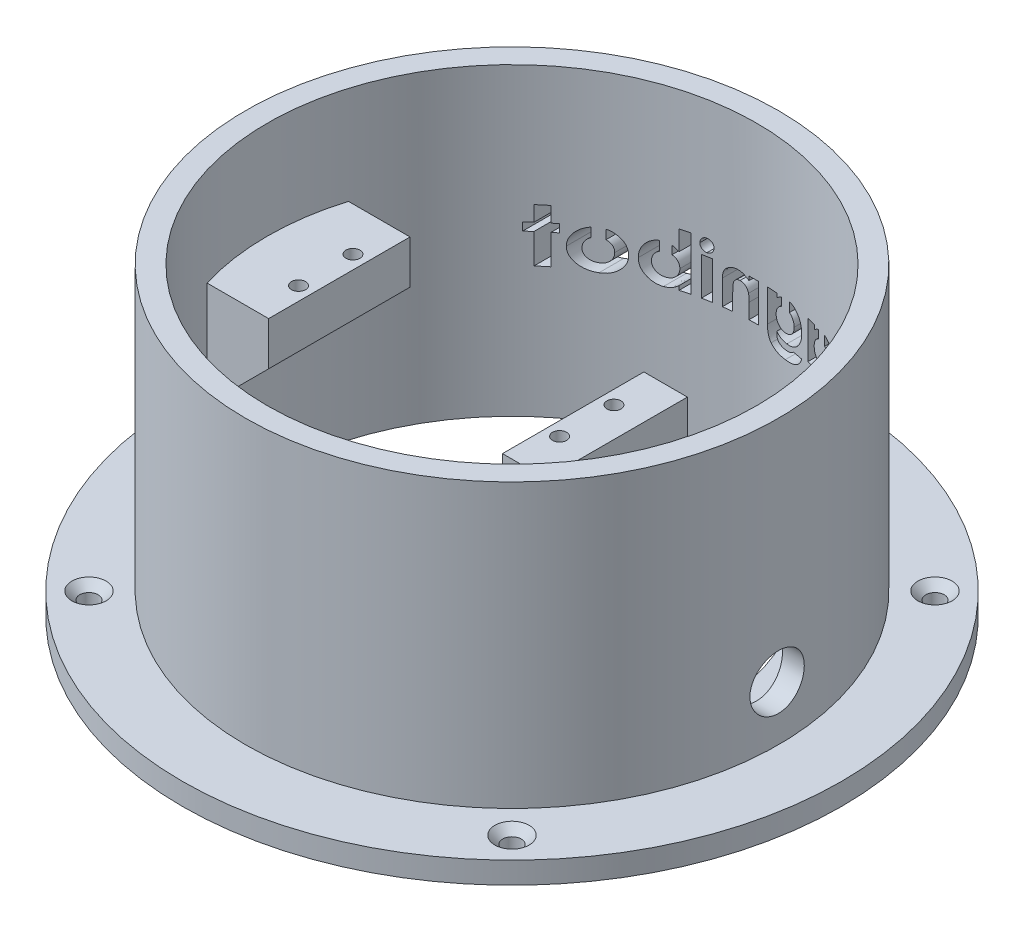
from build123d import *

# Parameters (mm, degrees)
SKETCH1_R                                           = 60.625
SKETCH1_R_2                                         = 45
BOSS_EXTRUDE1_DEPTH                                 = 4
SKETCH2_R                                           = 49
SKETCH2_R_2                                         = 45
BOSS_EXTRUDE2_DEPTH                                 = 52
SKETCH4_W                                           = 13.25
SKETCH4_H                                           = 8
SKETCH4_W_2                                         = 8
SKETCH4_H_2                                         = 38
BOSS_EXTRUDE4_DEPTH                                 = 13
BOSS_EXTRUDE5_DEPTH                                 = 4
SKETCH7_R                                           = 1.3
CUT_EXTRUDE4_DEPTH                                  = 7.2
SKETCH9_W                                           = 10
SKETCH9_H                                           = 24
CUT_EXTRUDE7_DEPTH                                  = 8
CUT_EXTRUDE8_REACH                                  = 139.219
CUT_EXTRUDE8_END_RADIUS                             = 45
SKETCH11_R                                          = 5
CUT_EXTRUDE9_DEPTH                                  = 101.273532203
CSK_FOR_M3_COUNTERSUNK_FLAT_HEAD_SCREW1_D           = 3.4
CSK_FOR_M3_COUNTERSUNK_FLAT_HEAD_SCREW1_CSINK_D     = 6.3
CSK_FOR_M3_COUNTERSUNK_FLAT_HEAD_SCREW1_CSINK_ANGLE = 90
SKETCH18_W                                          = 1.709615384
SKETCH18_H                                          = 6.960576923
CUT_EXTRUDE10_DEPTH                                 = 45


with BuildPart() as part:
    # Sketch1 → Boss-Extrude1 (new body)
    with BuildSketch(Plane(origin=(0, 0, 0), x_dir=(1, 0, 0), z_dir=(0, 1, 0))):
        with Locations(Location((0, 0, 0), (0, 0, 270))):
            Circle(SKETCH1_R)
        with Locations(Location((0, 0, 0), (0, 0, 270))):
            Circle(SKETCH1_R_2, mode=Mode.SUBTRACT)
    extrude(amount=BOSS_EXTRUDE1_DEPTH)

    # Sketch2 → Boss-Extrude2 (add)
    with BuildSketch(Plane(origin=(0, 4, 0), x_dir=(1, 0, 0), z_dir=(0, 1, 0))):
        with Locations(Location((0, 0, 0), (0, 0, 90))):
            Circle(SKETCH2_R)
        with Locations(Location((0, 0, 0), (0, 0, 270))):
            Circle(SKETCH2_R_2, mode=Mode.SUBTRACT)
    extrude(amount=BOSS_EXTRUDE2_DEPTH)

    # Sketch4 → Boss-Extrude4 (add, symmetric)
    with BuildSketch(Plane.XY):
        with Locations((-38.375, 34)):
            Rectangle(SKETCH4_W, SKETCH4_H)
        Polygon((-31.75, 30), (-45, 30), (-45, 16.75), align=None)
        with Locations((15.25, 19)):
            Rectangle(SKETCH4_W_2, SKETCH4_H_2)
    extrude(amount=BOSS_EXTRUDE4_DEPTH, both=True)


with BuildPart() as boss_extrude4_piece_1:
    # of the separate pieces the step leaves, piece 1, a body of its own (boss_extrude4_pieces)
    add(part.part.solids().sort_by_distance((0, 0, 60.625))[0])



with BuildPart() as boss_extrude4_piece_2:
    # of the separate pieces the step leaves, piece 2, a body of its own (boss_extrude4_pieces)
    add(part.part.solids().sort_by_distance((11.25, 38, -13))[0])


with BuildPart() as boss_extrude4_piece_1_1:
    add(boss_extrude4_piece_1.part)

    add(boss_extrude4_piece_2.part)  # Boss-Extrude5 merges Boss-Extrude4 piece 2
    # Sketch5 → Boss-Extrude5 (add)
    with BuildSketch(Plane.XZ):
        with BuildLine():
            Line((11.25, 13), (29.067400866, 34.352382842))
            ThreePointArc((29.067400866, 34.352382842), (45, 0), (29.067400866, -34.352382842))
            Line((29.067400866, -34.352382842), (11.25, -13))
            Line((11.25, -13), (11.25, 13))
        make_face()
    extrude(amount=-BOSS_EXTRUDE5_DEPTH)

    # Sketch7 → Cut-Extrude4 (cut)
    with BuildSketch(Plane(origin=(0, 38, 0), x_dir=(1, 0, 0), z_dir=(0, 1, 0))):
        with Locations(Location((-34.25, 5, 0), (0, 0, 180))):
            Circle(SKETCH7_R)
        with Locations(Location((-34.25, -5, 0), (0, 0, 180))):
            Circle(SKETCH7_R)
        with Locations(Location((13.75, 5, 0), (0, 0, 180))):
            Circle(SKETCH7_R)
        with Locations(Location((13.75, -5, 0), (0, 0, 180))):
            Circle(SKETCH7_R)
    extrude(amount=-CUT_EXTRUDE4_DEPTH, mode=Mode.SUBTRACT)

    # Sketch9 → Cut-Extrude7 (cut)
    with BuildSketch(Plane.ZY.offset(-11.25)):
        with Locations((0, 17)):
            Rectangle(SKETCH9_W, SKETCH9_H)
    extrude(amount=-CUT_EXTRUDE7_DEPTH, mode=Mode.SUBTRACT)

    # Cut-Extrude8: up to this cylinder (the profile starts outside it)
    cut_extrude8_end = Plane(origin=(0, 14, 0), z_dir=(0, -1, 0)) * Cylinder(CUT_EXTRUDE8_END_RADIUS, 369.438, mode=Mode.PRIVATE)
    # Sketch11 → Cut-Extrude8 (cut, up to the surface)
    with BuildSketch(Plane(origin=(49, 0, 0), x_dir=(0, 0, -1), z_dir=(1, 0, 0)), mode=Mode.PRIVATE) as cut_extrude8_sk1:
        with Locations((0, 14)):
            Circle(SKETCH11_R)
    cut_extrude8_tool1 = extrude(cut_extrude8_sk1.sketch, amount=-CUT_EXTRUDE8_REACH, mode=Mode.PRIVATE) - cut_extrude8_end
    add(cut_extrude8_tool1.solids().sort_by_distance((49, 14, 0))[0], mode=Mode.SUBTRACT)

    # Sketch12 → Cut-Extrude9 (cut, through all)
    with BuildSketch(Plane(origin=(0, 4, 0), x_dir=(1, 0, 0), z_dir=(0, 1, 0))):
        with BuildLine():
            Line((29.479537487, 22.359715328), (27.25, 19.687836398))
            Line((27.25, 19.687836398), (27.25, -19.687836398))
            Line((27.25, -19.687836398), (29.479537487, -22.359715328))
            ThreePointArc((29.479537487, -22.359715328), (37, 0), (29.479537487, 22.359715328))
        make_face()
        Polygon((27.25, -19.687836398), (27.25, 19.687836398), (24.25, 16.092634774), (24.25, -16.092634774), align=None)
    extrude(amount=-CUT_EXTRUDE9_DEPTH, mode=Mode.SUBTRACT)

    # CSK for M3 Countersunk Flat Head Screw1 (through all)
    with Locations(Plane(origin=(0, 4, 0), x_dir=(1, 0, 0), z_dir=(0, 1, 0))):
        with Locations((-38.890872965, 38.890872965), (-38.890872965, -38.890872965), (38.890872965, -38.890872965), (38.890872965, 38.890872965)):
            CounterSinkHole(CSK_FOR_M3_COUNTERSUNK_FLAT_HEAD_SCREW1_D / 2, CSK_FOR_M3_COUNTERSUNK_FLAT_HEAD_SCREW1_CSINK_D / 2, counter_sink_angle=CSK_FOR_M3_COUNTERSUNK_FLAT_HEAD_SCREW1_CSINK_ANGLE)

    # Sketch18 → Cut-Extrude10 (cut)
    with BuildSketch(Plane(origin=(0, 0, -13), x_dir=(-1, 0, 0), z_dir=(0, 0, -1))):
        with BuildLine():
            add(Edge.make_bspline(
                [(-26.842487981, 29.495192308), (-26.988196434, 29.498038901), (-27.204965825, 29.462307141), (-27.475994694, 29.354907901), (-27.664862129, 29.241566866), (-27.836779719, 29.100355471), (-27.987937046, 28.932127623), (-28.113371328, 28.737009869), (-28.201046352, 28.555679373), (-28.254794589, 28.392139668), (-28.294305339, 28.251942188), (-28.323177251, 28.094008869), (-28.347279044, 27.920113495), (-28.369621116, 27.730048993), (-28.385267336, 27.442939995), (-28.394826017, 27.219060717), (-28.391826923, 27.064332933)],
                knots=[0, 0, 0, 0, 0.13355216, 0.199704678, 0.267120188, 0.335277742, 0.403628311, 0.474205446, 0.54799425, 0.588135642, 0.632411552, 0.681857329, 0.73562936, 0.793897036, 0.857789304, 1, 1, 1, 1], degree=3))
            Line((-28.391826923, 27.064332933), (-28.391826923, 24))
            Line((-28.391826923, 24), (-30.101442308, 24))
            Line((-30.101442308, 24), (-30.101442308, 30.960576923))
            Line((-30.101442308, 30.960576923), (-28.391826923, 30.960576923))
            Line((-28.391826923, 30.960576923), (-28.391826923, 30.128665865))
            add(Edge.make_bspline(
                [(-28.391826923, 30.128665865), (-28.246518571, 30.28386113), (-28.00929586, 30.492748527), (-27.659062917, 30.716852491), (-27.38650362, 30.85144348), (-27.10067853, 30.954023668), (-26.698562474, 31.056158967), (-26.384211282, 31.08134908), (-26.172761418, 31.082692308)],
                knots=[0, 0, 0, 0, 0.256335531, 0.379114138, 0.500550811, 0.622115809, 0.744714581, 1, 1, 1, 1], degree=3))
            add(Edge.make_bspline(
                [(-26.172761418, 31.082692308), (-25.960830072, 31.083493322), (-25.645660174, 31.046822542), (-25.250117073, 30.912238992), (-24.976393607, 30.770998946), (-24.72038138, 30.596258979), (-24.411202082, 30.302229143), (-24.225552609, 30.035457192), (-24.12351262, 29.842457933)],
                knots=[0, 0, 0, 0, 0.251955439, 0.373413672, 0.494801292, 0.617068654, 0.7406196, 1, 1, 1, 1], degree=3))
            add(Edge.make_bspline(
                [(-24.12351262, 29.842457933), (-23.98885255, 30.038239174), (-23.754904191, 30.305456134), (-23.388343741, 30.596264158), (-23.091852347, 30.772294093), (-22.777453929, 30.911749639), (-22.333011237, 31.046004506), (-21.983922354, 31.083556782), (-21.749894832, 31.082692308)],
                knots=[0, 0, 0, 0, 0.25544547, 0.37917652, 0.501904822, 0.625344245, 0.74827832, 1, 1, 1, 1], degree=3))
            add(Edge.make_bspline(
                [(-21.749894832, 31.082692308), (-21.511457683, 31.084814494), (-21.160136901, 31.042896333), (-20.719737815, 30.899120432), (-20.425124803, 30.746464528), (-20.158725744, 30.565394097), (-19.931721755, 30.351514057), (-19.743329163, 30.112219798), (-19.620661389, 29.888780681), (-19.541360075, 29.691234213), (-19.493476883, 29.519331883), (-19.448692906, 29.327381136), (-19.416513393, 29.112802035), (-19.386505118, 28.877610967), (-19.362172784, 28.520569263), (-19.354973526, 28.241721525), (-19.355288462, 28.048888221)],
                knots=[0, 0, 0, 0, 0.16090351, 0.236985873, 0.311729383, 0.384306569, 0.453908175, 0.521546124, 0.589231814, 0.625292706, 0.665128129, 0.709631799, 0.75836798, 0.811604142, 0.869763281, 1, 1, 1, 1], degree=3))
            Line((-19.355288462, 28.048888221), (-19.355288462, 24))
            Line((-19.355288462, 24), (-21.064903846, 24))
            Line((-21.064903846, 24), (-21.064903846, 27.495552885))
            add(Edge.make_bspline(
                [(-21.064903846, 27.495552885), (-21.068140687, 27.674833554), (-21.070356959, 27.932935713), (-21.106654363, 28.25937097), (-21.137126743, 28.470145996), (-21.18072093, 28.657138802), (-21.233878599, 28.820796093), (-21.295540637, 28.961354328), (-21.369995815, 29.078798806), (-21.453385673, 29.177705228), (-21.546144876, 29.262489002), (-21.647306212, 29.334821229), (-21.757787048, 29.396493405), (-21.880480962, 29.438131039), (-22.059414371, 29.483235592), (-22.200832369, 29.497359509), (-22.29750601, 29.495192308)],
                knots=[0, 0, 0, 0, 0.200235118, 0.287286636, 0.36626042, 0.437682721, 0.501179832, 0.55802122, 0.608412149, 0.655743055, 0.701943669, 0.748215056, 0.794251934, 0.84250453, 0.892236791, 1, 1, 1, 1], degree=3))
            add(Edge.make_bspline(
                [(-22.29750601, 29.495192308), (-22.447521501, 29.496164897), (-22.671943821, 29.466348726), (-22.949430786, 29.356428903), (-23.141804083, 29.246128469), (-23.316353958, 29.108174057), (-23.469039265, 28.944596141), (-23.595136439, 28.754397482), (-23.682423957, 28.577934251), (-23.736967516, 28.418375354), (-23.775443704, 28.281726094), (-23.805431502, 28.127195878), (-23.828915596, 27.95635021), (-23.851390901, 27.768221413), (-23.866979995, 27.483641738), (-23.8765728, 27.261678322), (-23.873557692, 27.108218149)],
                knots=[0, 0, 0, 0, 0.138576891, 0.20607346, 0.274463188, 0.342600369, 0.410740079, 0.480118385, 0.552600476, 0.591784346, 0.635663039, 0.683568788, 0.736964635, 0.79487093, 0.858420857, 1, 1, 1, 1], degree=3))
            Line((-23.873557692, 27.108218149), (-23.873557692, 24))
            Line((-23.873557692, 24), (-25.583173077, 24))
            Line((-25.583173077, 24), (-25.583173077, 27.337184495))
            add(Edge.make_bspline(
                [(-25.583173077, 27.337184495), (-25.581929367, 27.480364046), (-25.587494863, 27.687209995), (-25.602902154, 27.952402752), (-25.6182858, 28.127983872), (-25.636060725, 28.288035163), (-25.661704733, 28.431681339), (-25.68864776, 28.559713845), (-25.734841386, 28.70515501), (-25.799934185, 28.866327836), (-25.897184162, 29.037243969), (-26.014771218, 29.180341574), (-26.149729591, 29.29675473), (-26.302220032, 29.385397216), (-26.529198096, 29.475712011), (-26.717247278, 29.492268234), (-26.842487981, 29.495192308)],
                knots=[0, 0, 0, 0, 0.151067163, 0.218305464, 0.280286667, 0.337063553, 0.388152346, 0.434234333, 0.474994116, 0.549030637, 0.617296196, 0.681662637, 0.743542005, 0.804319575, 0.867012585, 1, 1, 1, 1], degree=3))
        make_face()
        with BuildLine():
            Line((-10.685096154, 30.960576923), (-12.394711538, 30.960576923))
            Line((-12.394711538, 30.960576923), (-12.394711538, 30.176367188))
            add(Edge.make_bspline(
                [(-13.394766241, 30.846325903), (-13.310273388, 30.811242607), (-13.135129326, 30.729510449), (-12.789159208, 30.520493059), (-12.5451071, 30.323924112), (-12.394711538, 30.176367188)],
                knots=[0.505665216, 0.505665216, 0.505665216, 0.505665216, 0.617680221, 0.742091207, 1, 1, 1, 1], degree=3))
            Line((-13.394766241, 30.846325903), (-13.394766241, 29.329440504))
            add(Edge.make_bspline(
                [(-12.272596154, 27.49936899), (-12.275060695, 27.640851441), (-12.286903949, 27.850610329), (-12.347552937, 28.118783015), (-12.407830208, 28.305751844), (-12.486754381, 28.48203362), (-12.585417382, 28.645666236), (-12.69736389, 28.802320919), (-12.829721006, 28.943228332), (-12.971811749, 29.07413986), (-13.126905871, 29.186060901), (-13.268832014, 29.269936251), (-13.359799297, 29.313990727), (-13.394766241, 29.329440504)],
                knots=[0, 0, 0, 0, 0.135095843, 0.199062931, 0.26154836, 0.322044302, 0.382646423, 0.443384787, 0.505154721, 0.566515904, 0.627254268, 0.687026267, 0.723436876, 0.723436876, 0.723436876, 0.723436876], degree=3))
            add(Edge.make_bspline(
                [(-14.235982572, 25.465384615), (-14.10011477, 25.467643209), (-13.898799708, 25.480332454), (-13.640806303, 25.53963291), (-13.460804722, 25.604109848), (-13.288221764, 25.681696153), (-13.124620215, 25.777647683), (-12.971773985, 25.89305892), (-12.828909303, 26.024925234), (-12.698001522, 26.169745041), (-12.58481344, 26.328550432), (-12.486224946, 26.496261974), (-12.408680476, 26.676846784), (-12.347134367, 26.867138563), (-12.286934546, 27.140607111), (-12.275196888, 27.354702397), (-12.272596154, 27.49936899)],
                knots=[0, 0, 0, 0, 0.128661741, 0.189789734, 0.249707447, 0.309188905, 0.368499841, 0.428643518, 0.489936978, 0.552121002, 0.612878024, 0.674050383, 0.735729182, 0.798304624, 0.862952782, 1, 1, 1, 1], degree=3))
            add(Edge.make_bspline(
                [(-16.180288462, 27.493644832), (-16.177753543, 27.352107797), (-16.165553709, 27.142550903), (-16.105972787, 26.873813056), (-16.042025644, 26.686589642), (-15.963884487, 26.507939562), (-15.868781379, 26.338693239), (-15.75196058, 26.181841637), (-15.622339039, 26.033673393), (-15.477365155, 25.901365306), (-15.324904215, 25.783886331), (-15.162873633, 25.685597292), (-14.993031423, 25.606139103), (-14.815948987, 25.541463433), (-14.564127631, 25.483260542), (-14.368366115, 25.465966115), (-14.235982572, 25.465384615)],
                knots=[0, 0, 0, 0, 0.135364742, 0.199460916, 0.262263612, 0.323991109, 0.385461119, 0.447170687, 0.510418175, 0.573170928, 0.634270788, 0.693953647, 0.753722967, 0.813083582, 0.873628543, 1, 1, 1, 1], degree=3))
            add(Edge.make_bspline(
                [(-15.104766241, 29.310891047), (-15.128357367, 29.299714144), (-15.207610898, 29.260034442), (-15.337370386, 29.180793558), (-15.488973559, 29.065116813), (-15.631033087, 28.934431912), (-15.760541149, 28.790785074), (-15.872185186, 28.634035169), (-15.967062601, 28.468406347), (-16.047311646, 28.293397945), (-16.10472424, 28.106949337), (-16.166516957, 27.841905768), (-16.177251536, 27.633746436), (-16.180288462, 27.493644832)],
                knots=[0.284645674, 0.284645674, 0.284645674, 0.284645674, 0.30974405, 0.369855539, 0.430536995, 0.492876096, 0.555257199, 0.616197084, 0.67757746, 0.738630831, 0.800921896, 0.864881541, 1, 1, 1, 1], degree=3))
            Line((-15.104766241, 29.310891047), (-15.104766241, 31.04733117))
            add(Edge.make_bspline(
                [(-17.889903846, 27.466932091), (-17.887893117, 27.720081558), (-17.86504439, 28.095154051), (-17.760403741, 28.575169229), (-17.655770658, 28.910764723), (-17.521064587, 29.22848271), (-17.357029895, 29.5288338), (-17.161404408, 29.811035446), (-16.935982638, 30.070283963), (-16.692582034, 30.307896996), (-16.432186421, 30.514760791), (-16.158868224, 30.690491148), (-15.872334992, 30.833991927), (-15.57263517, 30.944747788), (-15.315122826, 31.012054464), (-15.157587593, 31.039528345), (-15.104766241, 31.04733117)],
                knots=[0, 0, 0, 0, 0.139308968, 0.205473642, 0.26959838, 0.332253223, 0.394830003, 0.45737553, 0.520581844, 0.583374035, 0.644082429, 0.703039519, 0.761664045, 0.819843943, 0.878346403, 0.907680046, 0.907680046, 0.907680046, 0.907680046], degree=3))
            add(Edge.make_bspline(
                [(-14.550811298, 23.877884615), (-14.771194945, 23.875519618), (-15.097918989, 23.909256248), (-15.518197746, 24.017521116), (-15.819029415, 24.13040656), (-16.107936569, 24.27691408), (-16.387131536, 24.452984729), (-16.651827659, 24.664864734), (-16.904228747, 24.903368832), (-17.135325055, 25.165726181), (-17.337353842, 25.448294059), (-17.507641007, 25.747064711), (-17.647178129, 26.061049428), (-17.756829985, 26.390010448), (-17.863179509, 26.856878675), (-17.889066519, 27.221178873), (-17.889903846, 27.466932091)],
                knots=[0, 0, 0, 0, 0.121092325, 0.179634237, 0.238303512, 0.297437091, 0.357506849, 0.419513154, 0.483600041, 0.548295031, 0.611486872, 0.674312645, 0.737107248, 0.800159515, 0.864737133, 1, 1, 1, 1], degree=3))
            add(Edge.make_bspline(
                [(-12.394711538, 24.759405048), (-12.556438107, 24.613336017), (-12.80579393, 24.412909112), (-13.162727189, 24.202367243), (-13.424496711, 24.08000868), (-13.692348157, 23.989796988), (-14.064934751, 23.90107922), (-14.355434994, 23.879194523), (-14.550811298, 23.877884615)],
                knots=[0, 0, 0, 0, 0.273943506, 0.399987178, 0.519718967, 0.636176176, 0.754371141, 1, 1, 1, 1], degree=3))
            Line((-12.394711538, 24.759405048), (-12.394711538, 24))
            Line((-12.394711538, 24), (-10.685096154, 24))
            Line((-10.685096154, 24), (-10.685096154, 30.960576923))
        make_face()
        with BuildLine():
            Line((-2.014903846, 30.960576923), (-3.846634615, 30.960576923))
            Line((-3.846634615, 30.960576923), (-3.846634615, 30.185907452))
            add(Edge.make_bspline(
                [(-4.767307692, 30.814230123), (-4.724477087, 30.794772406), (-4.590493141, 30.729827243), (-4.269492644, 30.538805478), (-4.012351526, 30.336800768), (-3.846634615, 30.185907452)],
                knots=[0.536763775, 0.536763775, 0.536763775, 0.536763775, 0.595177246, 0.721609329, 1, 1, 1, 1], degree=3))
            Line((-4.767307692, 30.814230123), (-4.767307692, 29.320900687))
            add(Edge.make_bspline(
                [(-3.724519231, 27.547070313), (-3.723985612, 27.684921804), (-3.738077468, 27.888553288), (-3.795878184, 28.149010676), (-3.852746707, 28.331467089), (-3.92694536, 28.503911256), (-4.019968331, 28.66473411), (-4.126349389, 28.81690634), (-4.251607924, 28.955244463), (-4.386618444, 29.083193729), (-4.535464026, 29.191438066), (-4.662702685, 29.26982308), (-4.741830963, 29.309083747), (-4.767307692, 29.320900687)],
                knots=[0, 0, 0, 0, 0.135592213, 0.199608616, 0.261894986, 0.32322003, 0.383707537, 0.444249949, 0.505361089, 0.566851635, 0.626748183, 0.685935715, 0.713527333, 0.713527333, 0.713527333, 0.713527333], degree=3))
            add(Edge.make_bspline(
                [(-5.584870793, 25.5875), (-5.454885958, 25.585020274), (-5.263798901, 25.604031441), (-5.018163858, 25.660529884), (-4.845887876, 25.719523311), (-4.683344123, 25.796656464), (-4.528349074, 25.888670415), (-4.38419113, 26.000026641), (-4.248136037, 26.125920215), (-4.125355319, 26.26591114), (-4.016979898, 26.417589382), (-3.927957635, 26.580982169), (-3.852112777, 26.753503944), (-3.796017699, 26.93758312), (-3.737790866, 27.201095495), (-3.724286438, 27.407370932), (-3.724519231, 27.547070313)],
                knots=[0, 0, 0, 0, 0.128347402, 0.189067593, 0.248938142, 0.308023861, 0.366703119, 0.426834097, 0.487804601, 0.549753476, 0.610659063, 0.671749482, 0.733442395, 0.796702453, 0.861717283, 1, 1, 1, 1], degree=3))
            add(Edge.make_bspline(
                [(-7.510096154, 27.560426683), (-7.512631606, 27.421551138), (-7.493433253, 27.218005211), (-7.437602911, 26.955335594), (-7.376070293, 26.772902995), (-7.298907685, 26.599118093), (-7.206250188, 26.434062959), (-7.09186074, 26.281684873), (-6.964837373, 26.138630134), (-6.824314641, 26.009292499), (-6.67305439, 25.896795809), (-6.514171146, 25.799646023), (-6.344228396, 25.723890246), (-6.166910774, 25.66253924), (-5.914630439, 25.602081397), (-5.71748417, 25.59010512), (-5.584870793, 25.5875)],
                knots=[0, 0, 0, 0, 0.134674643, 0.197931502, 0.260447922, 0.321293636, 0.382442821, 0.443853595, 0.505984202, 0.568071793, 0.628986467, 0.688848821, 0.748567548, 0.80932852, 0.870916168, 1, 1, 1, 1], degree=3))
            add(Edge.make_bspline(
                [(-6.477307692, 29.308506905), (-6.496110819, 29.299218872), (-6.569021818, 29.261444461), (-6.691391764, 29.186398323), (-6.840503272, 29.074852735), (-6.977284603, 28.945757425), (-7.10407087, 28.806266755), (-7.210527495, 28.652749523), (-7.305390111, 28.493946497), (-7.379193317, 28.323470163), (-7.440093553, 28.14593706), (-7.491184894, 27.890883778), (-7.513785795, 27.694490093), (-7.510096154, 27.560426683)],
                knots=[0.292846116, 0.292846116, 0.292846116, 0.292846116, 0.313596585, 0.374077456, 0.434784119, 0.497609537, 0.5600519, 0.621032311, 0.682272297, 0.742887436, 0.804620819, 0.867735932, 1, 1, 1, 1], degree=3))
            Line((-6.477307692, 29.308506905), (-6.477307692, 31.053484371))
            add(Edge.make_bspline(
                [(-8.210351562, 30.182091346), (-8.062892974, 30.32841237), (-7.824605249, 30.524618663), (-7.477383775, 30.735792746), (-7.208361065, 30.861886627), (-6.928782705, 30.96208958), (-6.683039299, 31.021567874), (-6.531127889, 31.046194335), (-6.477307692, 31.053484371)],
                knots=[0, 0, 0, 0, 0.256681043, 0.3797841, 0.501470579, 0.623319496, 0.746312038, 0.8134232, 0.8134232, 0.8134232, 0.8134232], degree=3))
            add(Edge.make_bspline(
                [(-9.219711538, 27.541346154), (-9.221119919, 27.802624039), (-9.190880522, 28.187260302), (-9.085236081, 28.680667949), (-8.975256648, 29.02328411), (-8.830419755, 29.344336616), (-8.597264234, 29.747009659), (-8.376926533, 30.019294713), (-8.210351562, 30.182091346)],
                knots=[0, 0, 0, 0, 0.269734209, 0.396745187, 0.520318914, 0.64054729, 0.759723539, 1, 1, 1, 1], degree=3))
            add(Edge.make_bspline(
                [(-5.930228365, 24), (-6.152932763, 23.998495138), (-6.483421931, 24.029911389), (-6.90743633, 24.135684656), (-7.208893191, 24.243870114), (-7.494840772, 24.387709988), (-7.769346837, 24.558788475), (-8.027324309, 24.766145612), (-8.272332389, 24.998190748), (-8.493775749, 25.256120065), (-8.688634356, 25.533135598), (-8.852897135, 25.827326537), (-8.986509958, 26.13842036), (-9.092853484, 26.465107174), (-9.192743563, 26.93200642), (-9.218830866, 27.295560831), (-9.219711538, 27.541346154)],
                knots=[0, 0, 0, 0, 0.123700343, 0.183445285, 0.242476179, 0.301272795, 0.36098846, 0.421869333, 0.484863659, 0.548268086, 0.61043108, 0.672769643, 0.735140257, 0.798288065, 0.863379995, 1, 1, 1, 1], degree=3))
            add(Edge.make_bspline(
                [(-3.846634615, 24.868164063), (-3.98909843, 24.721521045), (-4.215491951, 24.523655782), (-4.547876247, 24.317476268), (-4.797702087, 24.197316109), (-5.059589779, 24.109448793), (-5.435024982, 24.022930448), (-5.72974928, 24.001013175), (-5.930228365, 24)],
                knots=[0, 0, 0, 0, 0.263927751, 0.385523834, 0.50370538, 0.620733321, 0.741155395, 1, 1, 1, 1], degree=3))
            add(Edge.make_bspline(
                [(-5.735606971, 22.900961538), (-5.525196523, 22.899276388), (-5.22448664, 22.923597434), (-4.851215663, 23.01425836), (-4.620987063, 23.11085449), (-4.422356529, 23.226997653), (-4.256650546, 23.361885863), (-4.119825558, 23.510466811), (-4.030327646, 23.650243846), (-3.977144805, 23.77704456), (-3.940929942, 23.886535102), (-3.913430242, 24.012742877), (-3.888388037, 24.153305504), (-3.869711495, 24.310034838), (-3.852264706, 24.549844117), (-3.844166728, 24.73762836), (-3.846634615, 24.868164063)],
                knots=[0, 0, 0, 0, 0.19772075, 0.282265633, 0.359994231, 0.431569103, 0.497870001, 0.560090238, 0.620807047, 0.652681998, 0.689174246, 0.729059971, 0.773983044, 0.823375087, 0.877349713, 1, 1, 1, 1], degree=3))
            add(Edge.make_bspline(
                [(-7.326923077, 23.511538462), (-7.242380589, 23.410960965), (-7.09438231, 23.276179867), (-6.865258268, 23.136766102), (-6.674394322, 23.050135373), (-6.464624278, 22.984387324), (-6.152217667, 22.915381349), (-5.904480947, 22.901982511), (-5.735606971, 22.900961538)],
                knots=[0, 0, 0, 0, 0.22365493, 0.337943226, 0.455777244, 0.579824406, 0.711809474, 1, 1, 1, 1], degree=3))
            Line((-7.326923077, 23.511538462), (-9.22734375, 23.511538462))
            add(Edge.make_bspline(
                [(-5.607767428, 21.313461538), (-5.923289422, 21.313265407), (-6.380155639, 21.337583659), (-6.955064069, 21.447487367), (-7.329970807, 21.55820764), (-7.669881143, 21.701190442), (-7.981201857, 21.872605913), (-8.263321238, 22.077558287), (-8.520560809, 22.307942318), (-8.746742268, 22.568885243), (-9.008284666, 22.958824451), (-9.152772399, 23.284583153), (-9.22734375, 23.511538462)],
                knots=[0, 0, 0, 0, 0.207410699, 0.299345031, 0.383942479, 0.463709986, 0.54113669, 0.616854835, 0.692286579, 0.767513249, 0.843065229, 1, 1, 1, 1], degree=3))
            add(Edge.make_bspline(
                [(-2.726607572, 22.435396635), (-2.883402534, 22.249158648), (-3.157412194, 22.001321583), (-3.579225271, 21.744105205), (-3.926838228, 21.584854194), (-4.305110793, 21.463833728), (-4.864867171, 21.343405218), (-5.305869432, 21.312752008), (-5.607767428, 21.313461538)],
                knots=[0, 0, 0, 0, 0.228421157, 0.343996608, 0.46295648, 0.586702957, 0.716302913, 1, 1, 1, 1], degree=3))
            add(Edge.make_bspline(
                [(-2.014903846, 25.022716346), (-2.01605019, 24.748857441), (-2.032888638, 24.350205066), (-2.10790658, 23.841573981), (-2.185622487, 23.501846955), (-2.286280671, 23.191966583), (-2.445487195, 22.825495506), (-2.603406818, 22.579293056), (-2.726607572, 22.435396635)],
                knots=[0, 0, 0, 0, 0.300233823, 0.436256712, 0.562884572, 0.681680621, 0.792783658, 1, 1, 1, 1], degree=3))
            Line((-2.014903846, 25.022716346), (-2.014903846, 30.960576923))
        make_face()
        with BuildLine():
            add(Edge.make_bspline(
                [(1.484465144, 28.171003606), (1.466486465, 28.102133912), (1.453307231, 27.985137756), (1.43216254, 27.814589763), (1.425478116, 27.651348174), (1.414090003, 27.46451461), (1.408057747, 27.168010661), (1.404442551, 26.933984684), (1.404326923, 26.770492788)],
                knots=[0, 0, 0, 0, 0.151475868, 0.251213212, 0.366854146, 0.500124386, 0.650932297, 1, 1, 1, 1], degree=3))
            Line((1.404326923, 26.770492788), (1.404326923, 24))
            Line((1.404326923, 24), (-0.305288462, 24))
            Line((-0.305288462, 24), (-0.305288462, 30.960576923))
            Line((-0.305288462, 30.960576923), (1.404326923, 30.960576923))
            Line((1.404326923, 30.960576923), (1.404326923, 30.22406851))
            add(Edge.make_bspline(
                [(1.404326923, 30.22406851), (1.588082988, 30.372253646), (1.863824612, 30.569162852), (2.239123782, 30.781038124), (2.496605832, 30.89620558), (2.749040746, 30.978882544), (3.08353522, 31.058574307), (3.339932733, 31.083729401), (3.510817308, 31.082692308)],
                knots=[0, 0, 0, 0, 0.30498931, 0.436681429, 0.556242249, 0.668759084, 0.77937854, 1, 1, 1, 1], degree=3))
            add(Edge.make_bspline(
                [(3.510817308, 31.082692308), (3.680448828, 31.08075736), (3.933391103, 31.064483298), (4.256758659, 30.985147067), (4.487401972, 30.907574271), (4.707179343, 30.805055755), (4.99224116, 30.641514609), (5.182040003, 30.47978274), (5.302478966, 30.365264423)],
                knots=[0, 0, 0, 0, 0.257369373, 0.381171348, 0.503298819, 0.625247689, 0.747811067, 1, 1, 1, 1], degree=3))
            add(Edge.make_bspline(
                [(5.302478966, 30.365264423), (5.405932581, 30.262683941), (5.5432377, 30.088552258), (5.685323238, 29.826244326), (5.773727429, 29.609531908), (5.83891886, 29.372851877), (5.908035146, 29.024814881), (5.921535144, 28.750707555), (5.922596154, 28.5640625)],
                knots=[0, 0, 0, 0, 0.223210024, 0.337545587, 0.456528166, 0.581243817, 0.713405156, 1, 1, 1, 1], degree=3))
            Line((5.922596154, 28.5640625), (5.922596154, 24))
            Line((5.922596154, 24), (4.212980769, 24))
            Line((4.212980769, 24), (4.212980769, 27.022355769))
            add(Edge.make_bspline(
                [(4.212980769, 27.022355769), (4.212493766, 27.211243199), (4.210812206, 27.481734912), (4.1962179, 27.824407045), (4.18675366, 28.042839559), (4.168165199, 28.234750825), (4.151402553, 28.401355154), (4.125681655, 28.541141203), (4.092214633, 28.691502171), (4.033772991, 28.852490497), (3.943045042, 29.022120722), (3.827944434, 29.166217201), (3.693170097, 29.285829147), (3.538879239, 29.38034416), (3.303028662, 29.472102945), (3.109660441, 29.495738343), (2.978470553, 29.495192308)],
                knots=[0, 0, 0, 0, 0.179518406, 0.256936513, 0.325929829, 0.387212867, 0.440139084, 0.484952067, 0.522188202, 0.586422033, 0.647003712, 0.704201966, 0.760716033, 0.817414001, 0.87521257, 1, 1, 1, 1], degree=3))
            add(Edge.make_bspline(
                [(2.978470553, 29.495192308), (2.805477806, 29.493406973), (2.544941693, 29.455299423), (2.233950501, 29.302362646), (2.025539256, 29.146180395), (1.84161366, 28.953101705), (1.632730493, 28.637036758), (1.530975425, 28.363566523), (1.484465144, 28.171003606)],
                knots=[0, 0, 0, 0, 0.240657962, 0.35738999, 0.477137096, 0.600008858, 0.725224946, 1, 1, 1, 1], degree=3))
        make_face()
        with Locations((8.364903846, 27.480288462)):
            Rectangle(SKETCH18_W, SKETCH18_H)
        with BuildLine():
            add(Edge.make_bspline(
                [(7.265865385, 32.750330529), (7.26826571, 32.898800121), (7.301809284, 33.123992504), (7.442819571, 33.387441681), (7.581566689, 33.56215972), (7.748301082, 33.708202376), (8.002527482, 33.849907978), (8.217416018, 33.892511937), (8.36108774, 33.891346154)],
                knots=[0, 0, 0, 0, 0.255026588, 0.378937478, 0.506522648, 0.634371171, 0.754975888, 1, 1, 1, 1], degree=3))
            add(Edge.make_bspline(
                [(8.36108774, 33.891346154), (8.50572535, 33.893726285), (8.722578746, 33.848887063), (8.976980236, 33.702667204), (9.145189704, 33.553861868), (9.284954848, 33.37588626), (9.429451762, 33.107458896), (9.461110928, 32.876834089), (9.463942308, 32.725525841)],
                knots=[0, 0, 0, 0, 0.242962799, 0.363854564, 0.490606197, 0.618739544, 0.743300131, 1, 1, 1, 1], degree=3))
            add(Edge.make_bspline(
                [(9.463942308, 32.725525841), (9.462823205, 32.575352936), (9.426744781, 32.34888392), (9.287851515, 32.08058497), (9.146978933, 31.905250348), (8.980599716, 31.758807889), (8.731970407, 31.610310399), (8.516181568, 31.571234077), (8.374444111, 31.571153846)],
                knots=[0, 0, 0, 0, 0.256468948, 0.381954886, 0.51070434, 0.637377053, 0.757775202, 1, 1, 1, 1], degree=3))
            add(Edge.make_bspline(
                [(8.374444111, 31.571153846), (8.228392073, 31.568584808), (8.010279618, 31.613961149), (7.752417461, 31.759104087), (7.584921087, 31.910946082), (7.44360454, 32.090205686), (7.304907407, 32.365264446), (7.265535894, 32.595858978), (7.265865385, 32.750330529)],
                knots=[0, 0, 0, 0, 0.242758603, 0.363442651, 0.489711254, 0.617482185, 0.742279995, 1, 1, 1, 1], degree=3))
        make_face()
        with BuildLine():
            Line((12.516826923, 30.149654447), (12.516826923, 33.769230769))
            Line((12.516826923, 33.769230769), (10.807211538, 33.769230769))
            Line((10.807211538, 33.769230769), (10.807211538, 24))
            Line((10.807211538, 24), (12.516826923, 24))
            Line((12.516826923, 24), (12.516826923, 24.759405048))
            add(Edge.make_bspline(
                [(14.676742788, 23.877884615), (14.481340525, 23.879044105), (14.190295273, 23.90141522), (13.816420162, 23.989838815), (13.547100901, 24.079591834), (13.284859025, 24.202413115), (12.927897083, 24.412875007), (12.678560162, 24.613354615), (12.516826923, 24.759405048)],
                knots=[0, 0, 0, 0, 0.245252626, 0.364042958, 0.481077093, 0.600625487, 0.726476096, 1, 1, 1, 1], degree=3))
            add(Edge.make_bspline(
                [(18.012019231, 27.466932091), (18.011181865, 27.221178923), (17.985294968, 26.856878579), (17.878945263, 26.390010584), (17.7692939, 26.061048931), (17.629754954, 25.747066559), (17.459474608, 25.448287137), (17.257420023, 25.165752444), (17.026422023, 24.903268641), (16.774022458, 24.665571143), (16.511040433, 24.452305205), (16.232237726, 24.277564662), (15.944584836, 24.129931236), (15.643546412, 24.017226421), (15.22306157, 23.909995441), (14.896589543, 23.874990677), (14.676742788, 23.877884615)],
                knots=[0, 0, 0, 0, 0.135343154, 0.199959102, 0.263048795, 0.32588067, 0.388743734, 0.451973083, 0.516706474, 0.580831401, 0.642600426, 0.702705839, 0.761562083, 0.820266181, 0.879181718, 1, 1, 1, 1], degree=3))
            add(Edge.make_bspline(
                [(15.218097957, 31.048901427), (15.274501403, 31.040721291), (15.436248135, 31.01276704), (15.697481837, 30.94541187), (15.996490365, 30.834072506), (16.281554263, 30.6893286), (16.555871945, 30.516072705), (16.814713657, 30.307102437), (17.058205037, 30.070412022), (17.283440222, 29.810980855), (17.479354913, 29.528924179), (17.642538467, 29.22795498), (17.780866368, 28.91162813), (17.881742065, 28.574710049), (17.987743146, 28.095349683), (18.009700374, 27.719978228), (18.012019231, 27.466932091)],
                knots=[0.090050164, 0.090050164, 0.090050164, 0.090050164, 0.121379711, 0.180255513, 0.238142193, 0.296488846, 0.355775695, 0.416246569, 0.479075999, 0.542319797, 0.604902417, 0.667516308, 0.730345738, 0.794404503, 0.860608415, 1, 1, 1, 1], degree=3))
            Line((15.218097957, 31.048901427), (15.218097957, 29.314704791))
            add(Edge.make_bspline(
                [(16.302403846, 27.493644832), (16.299366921, 27.633746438), (16.28863234, 27.841905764), (16.226839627, 28.106949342), (16.169427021, 28.293397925), (16.089178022, 28.468406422), (15.994300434, 28.634034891), (15.882657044, 28.790786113), (15.753146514, 28.934427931), (15.611096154, 29.06513148), (15.459459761, 29.180740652), (15.327073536, 29.261851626), (15.244691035, 29.302412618), (15.218097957, 29.314704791)],
                knots=[0, 0, 0, 0, 0.134801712, 0.198611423, 0.260756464, 0.321666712, 0.3829032, 0.443700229, 0.505935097, 0.568128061, 0.628667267, 0.688637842, 0.716736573, 0.716736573, 0.716736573, 0.716736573], degree=3))
            add(Edge.make_bspline(
                [(14.358097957, 25.465384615), (14.490373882, 25.46633226), (14.68583074, 25.482503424), (14.937152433, 25.542290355), (15.11434859, 25.60505308), (15.283662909, 25.686858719), (15.44663417, 25.782563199), (15.597636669, 25.902145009), (15.742594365, 26.0335741), (15.872292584, 26.181788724), (15.988648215, 26.339247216), (16.086387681, 26.507354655), (16.16400061, 26.686669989), (16.228126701, 26.87379101), (16.287641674, 27.142566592), (16.299883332, 27.352099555), (16.302403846, 27.493644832)],
                knots=[0, 0, 0, 0, 0.126400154, 0.186367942, 0.246314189, 0.305548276, 0.365764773, 0.426396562, 0.489163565, 0.552425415, 0.614148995, 0.67593532, 0.737676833, 0.80049379, 0.86460452, 1, 1, 1, 1], degree=3))
            add(Edge.make_bspline(
                [(12.394711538, 27.49936899), (12.39733176, 27.354714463), (12.409013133, 27.140584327), (12.469300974, 26.867170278), (12.530611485, 26.676732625), (12.60888957, 26.496971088), (12.704293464, 26.327226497), (12.820695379, 26.17121855), (12.94886675, 26.023478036), (13.093980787, 25.893815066), (13.246613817, 25.77752438), (13.410369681, 25.681729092), (13.582911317, 25.604100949), (13.762924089, 25.539635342), (14.020913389, 25.480330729), (14.222231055, 25.467644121), (14.358097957, 25.465384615)],
                knots=[0, 0, 0, 0, 0.137033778, 0.201675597, 0.264244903, 0.325917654, 0.386784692, 0.447888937, 0.509667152, 0.571398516, 0.631536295, 0.690841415, 0.75031704, 0.810228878, 0.871350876, 1, 1, 1, 1], degree=3))
            add(Edge.make_bspline(
                [(13.508097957, 29.326291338), (13.475510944, 29.311704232), (13.386886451, 29.268645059), (13.247188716, 29.186777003), (13.09386491, 29.07271497), (12.949642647, 28.94476397), (12.820047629, 28.800818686), (12.704913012, 28.647005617), (12.609396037, 28.481322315), (12.529762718, 28.305867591), (12.469718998, 28.118750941), (12.40898317, 27.850633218), (12.397195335, 27.640839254), (12.394711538, 27.49936899)],
                knots=[0.277795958, 0.277795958, 0.277795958, 0.277795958, 0.311877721, 0.371779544, 0.432159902, 0.494105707, 0.555600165, 0.616830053, 0.677256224, 0.737883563, 0.800504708, 0.864610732, 1, 1, 1, 1], degree=3))
            Line((13.508097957, 29.326291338), (13.508097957, 30.833955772))
            add(Edge.make_bspline(
                [(12.516826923, 30.149654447), (12.668928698, 30.299917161), (12.912962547, 30.504541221), (13.258580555, 30.713964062), (13.428489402, 30.799029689), (13.508097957, 30.833955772)],
                knots=[0, 0, 0, 0, 0.260395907, 0.385476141, 0.491295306, 0.491295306, 0.491295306, 0.491295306], degree=3))
        make_face()
        with BuildLine():
            Line((21.981760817, 29.304311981), (21.981760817, 30.990172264))
            add(Edge.make_bspline(
                [(20.414257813, 30.149654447), (20.580230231, 30.302431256), (20.848059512, 30.503701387), (21.231130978, 30.721932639), (21.52441704, 30.855237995), (21.777036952, 30.938516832), (21.930908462, 30.97825349), (21.981760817, 30.990172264)],
                knots=[0, 0, 0, 0, 0.25846437, 0.382579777, 0.504990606, 0.627227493, 0.687100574, 0.687100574, 0.687100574, 0.687100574], degree=3))
            add(Edge.make_bspline(
                [(19.233173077, 27.474564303), (19.2335763, 27.732374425), (19.268375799, 28.114139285), (19.392162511, 28.603345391), (19.522692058, 28.948059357), (19.689731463, 29.27621159), (19.964736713, 29.697053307), (20.225541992, 29.976313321), (20.414257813, 30.149654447)],
                knots=[0, 0, 0, 0, 0.256473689, 0.3792365, 0.500977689, 0.622366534, 0.744855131, 1, 1, 1, 1], degree=3))
            add(Edge.make_bspline(
                [(22.801231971, 23.877884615), (22.563052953, 23.880280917), (22.208301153, 23.907196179), (21.753165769, 24.018978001), (21.42903909, 24.133926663), (21.117747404, 24.28136963), (20.822016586, 24.463816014), (20.538902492, 24.677713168), (20.273309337, 24.921242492), (20.029990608, 25.188416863), (19.817420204, 25.473623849), (19.636938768, 25.772588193), (19.488669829, 26.085653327), (19.374345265, 26.41323899), (19.262282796, 26.87402685), (19.235504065, 27.233231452), (19.233173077, 27.474564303)],
                knots=[0, 0, 0, 0, 0.126883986, 0.188200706, 0.248894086, 0.309598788, 0.371125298, 0.433465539, 0.498143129, 0.562592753, 0.625474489, 0.687114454, 0.748124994, 0.809456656, 0.871431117, 1, 1, 1, 1], degree=3))
            add(Edge.make_bspline(
                [(26.437980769, 27.48601262), (26.437771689, 27.326640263), (26.42355562, 27.088337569), (26.371251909, 26.776261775), (26.321021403, 26.546146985), (26.251080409, 26.321815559), (26.169383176, 26.099962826), (26.069090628, 25.883612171), (25.958211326, 25.67040356), (25.831359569, 25.466611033), (25.695342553, 25.271609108), (25.544597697, 25.0905136), (25.387421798, 24.917708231), (25.216359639, 24.759036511), (25.034141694, 24.611922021), (24.842345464, 24.474566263), (24.639591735, 24.350191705), (24.428477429, 24.240908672), (24.212562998, 24.142379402), (23.990585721, 24.060352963), (23.763005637, 23.993439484), (23.529682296, 23.941716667), (23.20926933, 23.894089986), (22.965206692, 23.877055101), (22.801231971, 23.877884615)],
                knots=[0, 0, 0, 0, 0.083839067, 0.125192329, 0.166335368, 0.207601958, 0.248670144, 0.290582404, 0.332926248, 0.374978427, 0.416740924, 0.457856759, 0.498808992, 0.539515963, 0.580420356, 0.621910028, 0.663502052, 0.705394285, 0.746863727, 0.788245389, 0.82973641, 0.871532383, 0.913824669, 1, 1, 1, 1], degree=3))
            add(Edge.make_bspline(
                [(23.691760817, 30.974228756), (23.707235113, 30.970443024), (23.798744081, 30.947271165), (23.965029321, 30.895719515), (24.187697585, 30.811543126), (24.408574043, 30.714892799), (24.622176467, 30.59984678), (24.830048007, 30.475068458), (25.027122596, 30.337427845), (25.211763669, 30.188005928), (25.387398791, 30.030267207), (25.54584308, 29.857344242), (25.697221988, 29.677569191), (25.833356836, 29.484501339), (25.95939823, 29.282845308), (26.071611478, 29.073767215), (26.169049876, 28.858721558), (26.253610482, 28.640681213), (26.319844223, 28.416991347), (26.374587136, 28.19059772), (26.421309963, 27.880012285), (26.438917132, 27.644324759), (26.437980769, 27.48601262)],
                knots=[0.15930871, 0.15930871, 0.15930871, 0.15930871, 0.167705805, 0.209066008, 0.25097289, 0.293148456, 0.336041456, 0.37876116, 0.420892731, 0.462622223, 0.503914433, 0.545187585, 0.586138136, 0.627721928, 0.669584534, 0.711432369, 0.752690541, 0.793970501, 0.834591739, 0.875576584, 0.916639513, 1, 1, 1, 1], degree=3))
            Line((23.691760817, 30.974228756), (23.691760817, 29.30921563))
            add(Edge.make_bspline(
                [(24.728365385, 27.489828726), (24.728945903, 27.632177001), (24.714416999, 27.841892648), (24.657856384, 28.110603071), (24.597790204, 28.296751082), (24.523568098, 28.473587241), (24.431920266, 28.640204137), (24.32188708, 28.795781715), (24.197146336, 28.939548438), (24.059183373, 29.069218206), (23.912832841, 29.184852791), (23.787437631, 29.260713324), (23.712492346, 29.299107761), (23.691760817, 29.30921563)],
                knots=[0, 0, 0, 0, 0.137840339, 0.202697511, 0.265405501, 0.326938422, 0.388125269, 0.449116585, 0.511100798, 0.572085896, 0.632197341, 0.691338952, 0.713657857, 0.713657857, 0.713657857, 0.713657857], degree=3))
            add(Edge.make_bspline(
                [(22.826036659, 25.465384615), (22.957110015, 25.465812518), (23.151186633, 25.482865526), (23.399864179, 25.542073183), (23.575426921, 25.603342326), (23.741604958, 25.683803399), (23.899033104, 25.782329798), (24.049096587, 25.896762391), (24.186846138, 26.030758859), (24.31435775, 26.176097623), (24.426179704, 26.333725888), (24.519615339, 26.50224728), (24.596275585, 26.680600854), (24.655666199, 26.868543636), (24.711929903, 27.137869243), (24.730761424, 27.347201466), (24.728365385, 27.489828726)],
                knots=[0, 0, 0, 0, 0.126396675, 0.18693923, 0.24609921, 0.305348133, 0.364571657, 0.424924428, 0.486952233, 0.549550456, 0.611149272, 0.672921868, 0.735010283, 0.798048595, 0.862642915, 1, 1, 1, 1], degree=3))
            add(Edge.make_bspline(
                [(20.942788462, 27.489828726), (20.942208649, 27.345604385), (20.956456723, 27.133277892), (21.01364796, 26.860923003), (21.072949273, 26.6719944), (21.147614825, 26.492765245), (21.239199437, 26.324244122), (21.348692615, 26.167443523), (21.472829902, 26.022556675), (21.608755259, 25.891041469), (21.757691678, 25.778179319), (21.913401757, 25.680119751), (22.079476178, 25.601353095), (22.253547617, 25.540575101), (22.501228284, 25.479696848), (22.695353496, 25.467955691), (22.826036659, 25.465384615)],
                knots=[0, 0, 0, 0, 0.139455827, 0.204809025, 0.268587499, 0.330586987, 0.392213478, 0.453609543, 0.515091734, 0.576401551, 0.636039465, 0.695407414, 0.753980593, 0.813284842, 0.873377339, 1, 1, 1, 1], degree=3))
            add(Edge.make_bspline(
                [(21.981760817, 29.304311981), (21.962194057, 29.294476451), (21.8886201, 29.255913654), (21.763327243, 29.181378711), (21.617610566, 29.062737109), (21.478497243, 28.932596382), (21.352213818, 28.788078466), (21.244606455, 28.630626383), (21.148464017, 28.466263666), (21.075537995, 28.288973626), (21.015286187, 28.103599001), (20.959487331, 27.837284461), (20.940424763, 27.630588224), (20.942788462, 27.489828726)],
                knots=[0.284998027, 0.284998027, 0.284998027, 0.284998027, 0.306285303, 0.365703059, 0.4264774, 0.488621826, 0.550895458, 0.612678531, 0.673914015, 0.735734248, 0.798735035, 0.86329015, 1, 1, 1, 1], degree=3))
        make_face()
        Polygon((28.025480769, 30.960576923), (28.025480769, 33.769230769), (29.735096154, 33.769230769), (29.735096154, 30.960576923), (30.834134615, 30.960576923), (30.834134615, 29.495192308), (29.735096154, 29.495192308), (29.735096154, 24), (28.025480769, 24), (28.025480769, 29.495192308), (27.170673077, 29.495192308), (27.170673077, 30.960576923), align=None)
    extrude(amount=CUT_EXTRUDE10_DEPTH, mode=Mode.SUBTRACT)


solid = boss_extrude4_piece_1_1.part
